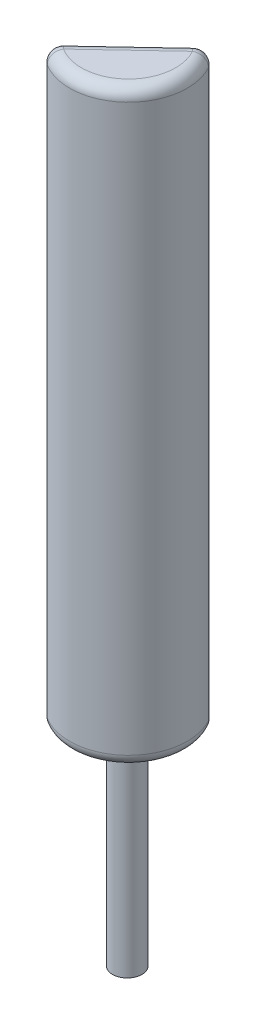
ISO-10303-21;
HEADER;
FILE_DESCRIPTION(('STEP AP214'),'2;1');
FILE_NAME('part.step','',(''),(''),'','','');
FILE_SCHEMA(('AUTOMOTIVE_DESIGN { 1 0 10303 214 1 1 1 1 }'));
ENDSEC;
DATA;
#1=APPLICATION_CONTEXT('core data for automotive mechanical design processes');
#2=APPLICATION_PROTOCOL_DEFINITION('international standard','automotive_design',2000,#1);
#3=PRODUCT_CONTEXT('',#1,'mechanical');
#4=PRODUCT('Part','Part','',(#3));
#5=PRODUCT_RELATED_PRODUCT_CATEGORY('part','',(#4));
#6=PRODUCT_DEFINITION_FORMATION('','',#4);
#7=PRODUCT_DEFINITION_CONTEXT('part definition',#1,'design');
#8=PRODUCT_DEFINITION('design','',#6,#7);
#9=PRODUCT_DEFINITION_SHAPE('','',#8);
#10=(LENGTH_UNIT() NAMED_UNIT(*) SI_UNIT(.MILLI.,.METRE.));
#11=(NAMED_UNIT(*) PLANE_ANGLE_UNIT() SI_UNIT($,.RADIAN.));
#12=(NAMED_UNIT(*) SI_UNIT($,.STERADIAN.) SOLID_ANGLE_UNIT());
#13=UNCERTAINTY_MEASURE_WITH_UNIT(LENGTH_MEASURE(1.E-05),#10,'distance_accuracy_value','');
#14=(GEOMETRIC_REPRESENTATION_CONTEXT(3) GLOBAL_UNCERTAINTY_ASSIGNED_CONTEXT((#13)) GLOBAL_UNIT_ASSIGNED_CONTEXT((#10,
#11,#12)) REPRESENTATION_CONTEXT('',''));
#15=CARTESIAN_POINT('',(0.,0.,0.));
#16=DIRECTION('',(0.,0.,1.));
#17=DIRECTION('',(1.,0.,0.));
#18=AXIS2_PLACEMENT_3D('',#15,#16,#17);
#19=CARTESIAN_POINT('',(0.,0.,0.));
#20=DIRECTION('',(0.,-1.,0.));
#21=DIRECTION('',(0.,0.,-1.));
#22=AXIS2_PLACEMENT_3D('',#19,#20,#21);
#23=PLANE('',#22);
#24=CARTESIAN_POINT('',(0.,0.,0.));
#25=DIRECTION('',(0.,-1.,0.));
#26=DIRECTION('',(0.,0.,-1.));
#27=AXIS2_PLACEMENT_3D('',#24,#25,#26);
#28=CIRCLE('',#27,3.2);
#29=CARTESIAN_POINT('',(2.80519584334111,0.,-1.539765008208));
#30=VERTEX_POINT('',#29);
#31=CARTESIAN_POINT('',(-1.70911083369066,0.,2.7053539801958));
#32=VERTEX_POINT('',#31);
#33=EDGE_CURVE('E120',#30,#32,#28,.T.);
#34=ORIENTED_EDGE('',*,*,#33,.T.);
#35=DIRECTION('',(-0.728493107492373,0.,0.685053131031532));
#36=VECTOR('',#35,1.);
#37=CARTESIAN_POINT('',(3.46201493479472,0.,-2.15741803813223));
#38=LINE('',#37,#36);
#39=EDGE_CURVE('E91',#32,#30,#38,.F.);
#40=ORIENTED_EDGE('',*,*,#39,.T.);
#41=EDGE_LOOP('',(#34,#40));
#42=FACE_BOUND('',#41,.T.);
#43=CARTESIAN_POINT('',(1.37010626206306,0.,1.45698621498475));
#44=DIRECTION('',(0.,-1.,0.));
#45=DIRECTION('',(0.,0.,-1.));
#46=AXIS2_PLACEMENT_3D('',#43,#44,#45);
#47=CIRCLE('',#46,1.);
#48=CARTESIAN_POINT('',(1.37010626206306,0.,2.45698621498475));
#49=VERTEX_POINT('',#48);
#50=EDGE_CURVE('E155',#49,#49,#47,.T.);
#51=ORIENTED_EDGE('',*,*,#50,.F.);
#52=EDGE_LOOP('',(#51));
#53=FACE_BOUND('',#52,.T.);
#54=ADVANCED_FACE('F32',(#42,#53),#23,.T.);
#55=CARTESIAN_POINT('',(0.,40.,0.));
#56=DIRECTION('',(0.,-1.,0.));
#57=DIRECTION('',(0.,0.,-1.));
#58=AXIS2_PLACEMENT_3D('',#55,#56,#57);
#59=CYLINDRICAL_SURFACE('',#58,4.);
#60=DIRECTION('',(0.,-1.,0.));
#61=VECTOR('',#60,1.);
#62=CARTESIAN_POINT('',(-2.13638854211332,40.,3.38169247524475));
#63=LINE('',#62,#61);
#64=CARTESIAN_POINT('',(-2.13638854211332,39.2,3.38169247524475));
#65=VERTEX_POINT('',#64);
#66=CARTESIAN_POINT('',(-2.13638854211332,0.800000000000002,3.38169247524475));
#67=VERTEX_POINT('',#66);
#68=EDGE_CURVE('E52',#65,#67,#63,.T.);
#69=ORIENTED_EDGE('',*,*,#68,.T.);
#70=CARTESIAN_POINT('',(0.,0.800000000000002,0.));
#71=DIRECTION('',(0.,-1.,0.));
#72=DIRECTION('',(0.,0.,-1.));
#73=AXIS2_PLACEMENT_3D('',#70,#71,#72);
#74=CIRCLE('',#73,4.);
#75=CARTESIAN_POINT('',(3.50649480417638,0.800000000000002,-1.92470626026));
#76=VERTEX_POINT('',#75);
#77=EDGE_CURVE('E11',#67,#76,#74,.F.);
#78=ORIENTED_EDGE('',*,*,#77,.T.);
#79=DIRECTION('',(0.,-1.,0.));
#80=VECTOR('',#79,1.);
#81=CARTESIAN_POINT('',(3.50649480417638,40.,-1.92470626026));
#82=LINE('',#81,#80);
#83=CARTESIAN_POINT('',(3.50649480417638,39.2,-1.92470626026));
#84=VERTEX_POINT('',#83);
#85=EDGE_CURVE('E41',#76,#84,#82,.F.);
#86=ORIENTED_EDGE('',*,*,#85,.T.);
#87=CARTESIAN_POINT('',(0.,39.2,0.));
#88=DIRECTION('',(0.,-1.,0.));
#89=DIRECTION('',(0.,0.,-1.));
#90=AXIS2_PLACEMENT_3D('',#87,#88,#89);
#91=CIRCLE('',#90,4.);
#92=EDGE_CURVE('E131',#84,#65,#91,.T.);
#93=ORIENTED_EDGE('',*,*,#92,.T.);
#94=EDGE_LOOP('',(#69,#78,#86,#93));
#95=FACE_BOUND('',#94,.T.);
#96=ADVANCED_FACE('F180',(#95),#59,.T.);
#97=CARTESIAN_POINT('',(-2.91397242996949,40.,2.74021252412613));
#98=DIRECTION('',(0.685053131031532,0.,0.728493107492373));
#99=DIRECTION('',(0.728493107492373,0.,-0.685053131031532));
#100=AXIS2_PLACEMENT_3D('',#97,#98,#99);
#101=PLANE('',#100);
#102=DIRECTION('',(-0.728493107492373,0.,0.685053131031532));
#103=VECTOR('',#102,1.);
#104=CARTESIAN_POINT('',(-2.91397242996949,39.2,2.74021252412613));
#105=LINE('',#104,#103);
#106=CARTESIAN_POINT('',(-2.25715333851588,39.2,2.1225594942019));
#107=VERTEX_POINT('',#106);
#108=CARTESIAN_POINT('',(2.25715333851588,39.2,-2.1225594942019));
#109=VERTEX_POINT('',#108);
#110=EDGE_CURVE('E112',#107,#109,#105,.F.);
#111=ORIENTED_EDGE('',*,*,#110,.T.);
#112=DIRECTION('',(0.,-1.,0.));
#113=VECTOR('',#112,1.);
#114=CARTESIAN_POINT('',(2.25715333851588,40.,-2.1225594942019));
#115=LINE('',#114,#113);
#116=CARTESIAN_POINT('',(2.25715333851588,0.800000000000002,-2.1225594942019));
#117=VERTEX_POINT('',#116);
#118=EDGE_CURVE('E117',#109,#117,#115,.T.);
#119=ORIENTED_EDGE('',*,*,#118,.T.);
#120=DIRECTION('',(-0.728493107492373,0.,0.685053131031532));
#121=VECTOR('',#120,1.);
#122=CARTESIAN_POINT('',(-2.91397242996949,0.800000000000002,2.74021252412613));
#123=LINE('',#122,#121);
#124=CARTESIAN_POINT('',(-2.25715333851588,0.800000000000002,2.1225594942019));
#125=VERTEX_POINT('',#124);
#126=EDGE_CURVE('E89',#117,#125,#123,.T.);
#127=ORIENTED_EDGE('',*,*,#126,.T.);
#128=DIRECTION('',(0.,-1.,0.));
#129=VECTOR('',#128,1.);
#130=CARTESIAN_POINT('',(-2.25715333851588,40.,2.1225594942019));
#131=LINE('',#130,#129);
#132=EDGE_CURVE('E106',#125,#107,#131,.F.);
#133=ORIENTED_EDGE('',*,*,#132,.T.);
#134=EDGE_LOOP('',(#111,#119,#127,#133));
#135=FACE_BOUND('',#134,.T.);
#136=ADVANCED_FACE('F115',(#135),#101,.F.);
#137=CARTESIAN_POINT('',(0.,40.,0.));
#138=DIRECTION('',(0.,-1.,0.));
#139=DIRECTION('',(0.,0.,-1.));
#140=AXIS2_PLACEMENT_3D('',#137,#138,#139);
#141=PLANE('',#140);
#142=CARTESIAN_POINT('',(0.,40.,0.));
#143=DIRECTION('',(0.,-1.,0.));
#144=DIRECTION('',(0.,0.,-1.));
#145=AXIS2_PLACEMENT_3D('',#142,#143,#144);
#146=CIRCLE('',#145,3.2);
#147=CARTESIAN_POINT('',(-1.70911083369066,40.,2.7053539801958));
#148=VERTEX_POINT('',#147);
#149=CARTESIAN_POINT('',(2.80519584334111,40.,-1.539765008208));
#150=VERTEX_POINT('',#149);
#151=EDGE_CURVE('E126',#148,#150,#146,.F.);
#152=ORIENTED_EDGE('',*,*,#151,.T.);
#153=DIRECTION('',(-0.728493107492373,0.,0.685053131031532));
#154=VECTOR('',#153,1.);
#155=CARTESIAN_POINT('',(0.548042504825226,40.,0.582794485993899));
#156=LINE('',#155,#154);
#157=EDGE_CURVE('E128',#150,#148,#156,.T.);
#158=ORIENTED_EDGE('',*,*,#157,.T.);
#159=EDGE_LOOP('',(#152,#158));
#160=FACE_BOUND('',#159,.T.);
#161=ADVANCED_FACE('F170',(#160),#141,.F.);
#162=CARTESIAN_POINT('',(1.37010626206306,-13.,1.45698621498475));
#163=DIRECTION('',(0.,1.,0.));
#164=DIRECTION('',(0.,0.,1.));
#165=AXIS2_PLACEMENT_3D('',#162,#163,#164);
#166=CYLINDRICAL_SURFACE('',#165,1.);
#167=CARTESIAN_POINT('',(1.37010626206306,-13.,1.45698621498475));
#168=DIRECTION('',(0.,-1.,0.));
#169=DIRECTION('',(0.,0.,-1.));
#170=AXIS2_PLACEMENT_3D('',#167,#168,#169);
#171=CIRCLE('',#170,1.);
#172=CARTESIAN_POINT('',(1.37010626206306,-13.,2.45698621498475));
#173=VERTEX_POINT('',#172);
#174=EDGE_CURVE('E113',#173,#173,#171,.T.);
#175=CARTESIAN_POINT('',(1.37010626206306,-13.,2.45698621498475));
#176=CARTESIAN_POINT('',(1.37010626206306,-12.8645833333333,2.45698621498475));
#177=CARTESIAN_POINT('',(1.37010626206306,-12.7291666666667,2.45698621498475));
#178=CARTESIAN_POINT('',(1.37010626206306,-12.4583333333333,2.45698621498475));
#179=CARTESIAN_POINT('',(1.37010626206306,-12.3229166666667,2.45698621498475));
#180=CARTESIAN_POINT('',(1.37010626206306,-12.0520833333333,2.45698621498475));
#181=CARTESIAN_POINT('',(1.37010626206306,-11.9166666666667,2.45698621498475));
#182=CARTESIAN_POINT('',(1.37010626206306,-11.6458333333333,2.45698621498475));
#183=CARTESIAN_POINT('',(1.37010626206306,-11.5104166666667,2.45698621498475));
#184=CARTESIAN_POINT('',(1.37010626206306,-11.2395833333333,2.45698621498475));
#185=CARTESIAN_POINT('',(1.37010626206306,-11.1041666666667,2.45698621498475));
#186=CARTESIAN_POINT('',(1.37010626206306,-10.8333333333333,2.45698621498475));
#187=CARTESIAN_POINT('',(1.37010626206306,-10.6979166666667,2.45698621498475));
#188=CARTESIAN_POINT('',(1.37010626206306,-10.4270833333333,2.45698621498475));
#189=CARTESIAN_POINT('',(1.37010626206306,-10.2916666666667,2.45698621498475));
#190=CARTESIAN_POINT('',(1.37010626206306,-10.0208333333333,2.45698621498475));
#191=CARTESIAN_POINT('',(1.37010626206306,-9.88541666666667,2.45698621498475));
#192=CARTESIAN_POINT('',(1.37010626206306,-9.61458333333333,2.45698621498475));
#193=CARTESIAN_POINT('',(1.37010626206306,-9.47916666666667,2.45698621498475));
#194=CARTESIAN_POINT('',(1.37010626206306,-9.20833333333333,2.45698621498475));
#195=CARTESIAN_POINT('',(1.37010626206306,-9.07291666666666,2.45698621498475));
#196=CARTESIAN_POINT('',(1.37010626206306,-8.80208333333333,2.45698621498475));
#197=CARTESIAN_POINT('',(1.37010626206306,-8.66666666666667,2.45698621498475));
#198=CARTESIAN_POINT('',(1.37010626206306,-8.39583333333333,2.45698621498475));
#199=CARTESIAN_POINT('',(1.37010626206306,-8.26041666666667,2.45698621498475));
#200=CARTESIAN_POINT('',(1.37010626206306,-7.98958333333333,2.45698621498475));
#201=CARTESIAN_POINT('',(1.37010626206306,-7.85416666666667,2.45698621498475));
#202=CARTESIAN_POINT('',(1.37010626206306,-7.58333333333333,2.45698621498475));
#203=CARTESIAN_POINT('',(1.37010626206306,-7.44791666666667,2.45698621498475));
#204=CARTESIAN_POINT('',(1.37010626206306,-7.17708333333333,2.45698621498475));
#205=CARTESIAN_POINT('',(1.37010626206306,-7.04166666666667,2.45698621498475));
#206=CARTESIAN_POINT('',(1.37010626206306,-6.77083333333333,2.45698621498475));
#207=CARTESIAN_POINT('',(1.37010626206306,-6.63541666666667,2.45698621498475));
#208=CARTESIAN_POINT('',(1.37010626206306,-6.36458333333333,2.45698621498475));
#209=CARTESIAN_POINT('',(1.37010626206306,-6.22916666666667,2.45698621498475));
#210=CARTESIAN_POINT('',(1.37010626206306,-5.95833333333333,2.45698621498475));
#211=CARTESIAN_POINT('',(1.37010626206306,-5.82291666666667,2.45698621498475));
#212=CARTESIAN_POINT('',(1.37010626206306,-5.55208333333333,2.45698621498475));
#213=CARTESIAN_POINT('',(1.37010626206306,-5.41666666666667,2.45698621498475));
#214=CARTESIAN_POINT('',(1.37010626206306,-5.14583333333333,2.45698621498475));
#215=CARTESIAN_POINT('',(1.37010626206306,-5.01041666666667,2.45698621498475));
#216=CARTESIAN_POINT('',(1.37010626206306,-4.73958333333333,2.45698621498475));
#217=CARTESIAN_POINT('',(1.37010626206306,-4.60416666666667,2.45698621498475));
#218=CARTESIAN_POINT('',(1.37010626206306,-4.33333333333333,2.45698621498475));
#219=CARTESIAN_POINT('',(1.37010626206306,-4.19791666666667,2.45698621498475));
#220=CARTESIAN_POINT('',(1.37010626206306,-3.92708333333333,2.45698621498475));
#221=CARTESIAN_POINT('',(1.37010626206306,-3.79166666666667,2.45698621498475));
#222=CARTESIAN_POINT('',(1.37010626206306,-3.52083333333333,2.45698621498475));
#223=CARTESIAN_POINT('',(1.37010626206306,-3.38541666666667,2.45698621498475));
#224=CARTESIAN_POINT('',(1.37010626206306,-3.11458333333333,2.45698621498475));
#225=CARTESIAN_POINT('',(1.37010626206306,-2.97916666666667,2.45698621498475));
#226=CARTESIAN_POINT('',(1.37010626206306,-2.70833333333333,2.45698621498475));
#227=CARTESIAN_POINT('',(1.37010626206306,-2.57291666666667,2.45698621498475));
#228=CARTESIAN_POINT('',(1.37010626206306,-2.30208333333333,2.45698621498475));
#229=CARTESIAN_POINT('',(1.37010626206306,-2.16666666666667,2.45698621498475));
#230=CARTESIAN_POINT('',(1.37010626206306,-1.89583333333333,2.45698621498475));
#231=CARTESIAN_POINT('',(1.37010626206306,-1.76041666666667,2.45698621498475));
#232=CARTESIAN_POINT('',(1.37010626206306,-1.48958333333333,2.45698621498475));
#233=CARTESIAN_POINT('',(1.37010626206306,-1.35416666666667,2.45698621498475));
#234=CARTESIAN_POINT('',(1.37010626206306,-1.08333333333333,2.45698621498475));
#235=CARTESIAN_POINT('',(1.37010626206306,-0.947916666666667,2.45698621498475));
#236=CARTESIAN_POINT('',(1.37010626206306,-0.677083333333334,2.45698621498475));
#237=CARTESIAN_POINT('',(1.37010626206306,-0.541666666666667,2.45698621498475));
#238=CARTESIAN_POINT('',(1.37010626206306,-0.270833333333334,2.45698621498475));
#239=CARTESIAN_POINT('',(1.37010626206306,-0.135416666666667,2.45698621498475));
#240=CARTESIAN_POINT('',(1.37010626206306,0.,2.45698621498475));
#241=B_SPLINE_CURVE_WITH_KNOTS('',3,(#175,#176,#177,#178,#179,#180,#181,#182,#183,#184,#185,
#186,#187,#188,#189,#190,#191,#192,#193,#194,#195,#196,#197,#198,#199,#200,#201,#202,#203,#204,
#205,#206,#207,#208,#209,#210,#211,#212,#213,#214,#215,#216,#217,#218,#219,#220,#221,#222,#223,
#224,#225,#226,#227,#228,#229,#230,#231,#232,#233,#234,#235,#236,#237,#238,#239,#240),
.UNSPECIFIED.,.F.,.F.,(4,2,2,2,2,2,2,2,2,2,2,2,2,2,2,2,2,2,2,2,2,2,2,2,2,2,2,2,2,2,2,2,4),(0.,
0.40625,0.812500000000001,1.21875,1.625,2.03125,2.4375,2.84375,3.25,3.65625,4.0625,4.46875,
4.875,5.28125,5.6875,6.09375,6.5,6.90625,7.3125,7.71875,8.125,8.53125,8.9375,9.34375,9.75,
10.15625,10.5625,10.96875,11.375,11.78125,12.1875,12.59375,13.),.UNSPECIFIED.);
#242=EDGE_CURVE('BSEAM168',#173,#49,#241,.T.);
#243=ORIENTED_EDGE('',*,*,#174,.F.);
#244=ORIENTED_EDGE('',*,*,#50,.T.);
#245=ORIENTED_EDGE('',*,*,#242,.T.);
#246=ORIENTED_EDGE('',*,*,#242,.F.);
#247=EDGE_LOOP('',(#243,#245,#244,#246));
#248=FACE_BOUND('',#247,.T.);
#249=ADVANCED_FACE('F168',(#248),#166,.T.);
#250=CARTESIAN_POINT('',(1.37010626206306,-13.,1.45698621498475));
#251=DIRECTION('',(0.,-1.,0.));
#252=DIRECTION('',(0.,0.,-1.));
#253=AXIS2_PLACEMENT_3D('',#250,#251,#252);
#254=PLANE('',#253);
#255=ORIENTED_EDGE('',*,*,#174,.T.);
#256=EDGE_LOOP('',(#255));
#257=FACE_BOUND('',#256,.T.);
#258=ADVANCED_FACE('F166',(#257),#254,.T.);
#259=CARTESIAN_POINT('',(0.548042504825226,39.2,0.582794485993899));
#260=DIRECTION('',(-0.728493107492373,0.,0.685053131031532));
#261=DIRECTION('',(0.685053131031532,0.,0.728493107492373));
#262=AXIS2_PLACEMENT_3D('',#259,#260,#261);
#263=CYLINDRICAL_SURFACE('',#262,0.8);
#264=CARTESIAN_POINT('',(-1.70911083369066,39.2,2.7053539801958));
#265=DIRECTION('',(-0.728493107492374,0.,0.685053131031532));
#266=DIRECTION('',(0.685053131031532,0.,0.728493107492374));
#267=AXIS2_PLACEMENT_3D('',#264,#265,#266);
#268=CIRCLE('',#267,0.8);
#269=EDGE_CURVE('E147',#148,#107,#268,.T.);
#270=ORIENTED_EDGE('',*,*,#269,.F.);
#271=ORIENTED_EDGE('',*,*,#157,.F.);
#272=CARTESIAN_POINT('',(2.80519584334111,39.2,-1.539765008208));
#273=DIRECTION('',(0.728493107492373,0.,-0.685053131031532));
#274=DIRECTION('',(-0.685053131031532,0.,-0.728493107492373));
#275=AXIS2_PLACEMENT_3D('',#272,#273,#274);
#276=CIRCLE('',#275,0.8);
#277=EDGE_CURVE('E149',#109,#150,#276,.T.);
#278=ORIENTED_EDGE('',*,*,#277,.F.);
#279=ORIENTED_EDGE('',*,*,#110,.F.);
#280=EDGE_LOOP('',(#270,#271,#278,#279));
#281=FACE_BOUND('',#280,.T.);
#282=ADVANCED_FACE('F34',(#281),#263,.T.);
#283=CARTESIAN_POINT('',(0.,39.2,0.));
#284=DIRECTION('',(0.,-1.,0.));
#285=DIRECTION('',(0.,0.,-1.));
#286=AXIS2_PLACEMENT_3D('',#283,#284,#285);
#287=TOROIDAL_SURFACE('',#286,3.2,0.8);
#288=CARTESIAN_POINT('',(2.80519584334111,39.2,-1.539765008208));
#289=DIRECTION('',(-0.481176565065,0.,-0.876623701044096));
#290=DIRECTION('',(-0.876623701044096,0.,0.481176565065));
#291=AXIS2_PLACEMENT_3D('',#288,#289,#290);
#292=CIRCLE('',#291,0.8);
#293=EDGE_CURVE('E36',#150,#84,#292,.T.);
#294=ORIENTED_EDGE('',*,*,#293,.F.);
#295=ORIENTED_EDGE('',*,*,#151,.F.);
#296=CARTESIAN_POINT('',(-1.70911083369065,39.2,2.7053539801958));
#297=DIRECTION('',(-0.845423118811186,0.,-0.534097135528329));
#298=DIRECTION('',(-0.534097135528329,0.,0.845423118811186));
#299=AXIS2_PLACEMENT_3D('',#296,#297,#298);
#300=CIRCLE('',#299,0.8);
#301=EDGE_CURVE('E145',#65,#148,#300,.T.);
#302=ORIENTED_EDGE('',*,*,#301,.F.);
#303=ORIENTED_EDGE('',*,*,#92,.F.);
#304=EDGE_LOOP('',(#294,#295,#302,#303));
#305=FACE_BOUND('',#304,.T.);
#306=ADVANCED_FACE('F215',(#305),#287,.T.);
#307=CARTESIAN_POINT('',(2.80519584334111,39.2,-1.539765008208));
#308=DIRECTION('',(0.,0.,1.));
#309=DIRECTION('',(1.,0.,0.));
#310=AXIS2_PLACEMENT_3D('',#307,#308,#309);
#311=SPHERICAL_SURFACE('',#310,0.8);
#312=ORIENTED_EDGE('',*,*,#277,.T.);
#313=ORIENTED_EDGE('',*,*,#293,.T.);
#314=CARTESIAN_POINT('',(2.80519584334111,39.2,-1.539765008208));
#315=DIRECTION('',(0.,1.,0.));
#316=DIRECTION('',(0.,0.,1.));
#317=AXIS2_PLACEMENT_3D('',#314,#315,#316);
#318=CIRCLE('',#317,0.8);
#319=EDGE_CURVE('E143',#109,#84,#318,.F.);
#320=ORIENTED_EDGE('',*,*,#319,.F.);
#321=EDGE_LOOP('',(#312,#313,#320));
#322=FACE_BOUND('',#321,.T.);
#323=ADVANCED_FACE('F212',(#322),#311,.T.);
#324=CARTESIAN_POINT('',(-1.70911083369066,39.2,2.7053539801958));
#325=DIRECTION('',(0.,0.,1.));
#326=DIRECTION('',(1.,0.,0.));
#327=AXIS2_PLACEMENT_3D('',#324,#325,#326);
#328=SPHERICAL_SURFACE('',#327,0.8);
#329=ORIENTED_EDGE('',*,*,#301,.T.);
#330=ORIENTED_EDGE('',*,*,#269,.T.);
#331=CARTESIAN_POINT('',(-1.70911083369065,39.2,2.7053539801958));
#332=DIRECTION('',(0.,1.,0.));
#333=DIRECTION('',(0.,0.,1.));
#334=AXIS2_PLACEMENT_3D('',#331,#332,#333);
#335=CIRCLE('',#334,0.8);
#336=EDGE_CURVE('E109',#65,#107,#335,.F.);
#337=ORIENTED_EDGE('',*,*,#336,.F.);
#338=EDGE_LOOP('',(#329,#330,#337));
#339=FACE_BOUND('',#338,.T.);
#340=ADVANCED_FACE('F208',(#339),#328,.T.);
#341=CARTESIAN_POINT('',(2.80519584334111,40.,-1.539765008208));
#342=DIRECTION('',(0.,-1.,0.));
#343=DIRECTION('',(0.,0.,-1.));
#344=AXIS2_PLACEMENT_3D('',#341,#342,#343);
#345=CYLINDRICAL_SURFACE('',#344,0.8);
#346=ORIENTED_EDGE('',*,*,#319,.T.);
#347=ORIENTED_EDGE('',*,*,#85,.F.);
#348=CARTESIAN_POINT('',(2.80519584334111,0.800000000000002,-1.539765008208));
#349=DIRECTION('',(0.,-1.,0.));
#350=DIRECTION('',(0.,0.,-1.));
#351=AXIS2_PLACEMENT_3D('',#348,#349,#350);
#352=CIRCLE('',#351,0.8);
#353=EDGE_CURVE('E103',#117,#76,#352,.T.);
#354=ORIENTED_EDGE('',*,*,#353,.F.);
#355=ORIENTED_EDGE('',*,*,#118,.F.);
#356=EDGE_LOOP('',(#346,#347,#354,#355));
#357=FACE_BOUND('',#356,.T.);
#358=ADVANCED_FACE('F205',(#357),#345,.T.);
#359=CARTESIAN_POINT('',(-1.70911083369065,40.,2.7053539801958));
#360=DIRECTION('',(0.,-1.,0.));
#361=DIRECTION('',(0.,0.,-1.));
#362=AXIS2_PLACEMENT_3D('',#359,#360,#361);
#363=CYLINDRICAL_SURFACE('',#362,0.8);
#364=ORIENTED_EDGE('',*,*,#336,.T.);
#365=ORIENTED_EDGE('',*,*,#132,.F.);
#366=CARTESIAN_POINT('',(-1.70911083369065,0.800000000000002,2.7053539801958));
#367=DIRECTION('',(0.,-1.,0.));
#368=DIRECTION('',(0.,0.,-1.));
#369=AXIS2_PLACEMENT_3D('',#366,#367,#368);
#370=CIRCLE('',#369,0.8);
#371=EDGE_CURVE('E97',#67,#125,#370,.T.);
#372=ORIENTED_EDGE('',*,*,#371,.F.);
#373=ORIENTED_EDGE('',*,*,#68,.F.);
#374=EDGE_LOOP('',(#364,#365,#372,#373));
#375=FACE_BOUND('',#374,.T.);
#376=ADVANCED_FACE('F107',(#375),#363,.T.);
#377=CARTESIAN_POINT('',(0.,0.800000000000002,0.));
#378=DIRECTION('',(0.,-1.,0.));
#379=DIRECTION('',(0.,0.,-1.));
#380=AXIS2_PLACEMENT_3D('',#377,#378,#379);
#381=TOROIDAL_SURFACE('',#380,3.2,0.8);
#382=CARTESIAN_POINT('',(2.80519584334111,0.800000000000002,-1.539765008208));
#383=DIRECTION('',(-0.481176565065,0.,-0.876623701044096));
#384=DIRECTION('',(-0.876623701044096,0.,0.481176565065));
#385=AXIS2_PLACEMENT_3D('',#382,#383,#384);
#386=CIRCLE('',#385,0.8);
#387=EDGE_CURVE('E139',#76,#30,#386,.T.);
#388=ORIENTED_EDGE('',*,*,#387,.F.);
#389=ORIENTED_EDGE('',*,*,#77,.F.);
#390=CARTESIAN_POINT('',(-1.70911083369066,0.8,2.7053539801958));
#391=DIRECTION('',(-0.845423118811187,0.,-0.534097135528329));
#392=DIRECTION('',(-0.534097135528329,0.,0.845423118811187));
#393=AXIS2_PLACEMENT_3D('',#390,#391,#392);
#394=CIRCLE('',#393,0.8);
#395=EDGE_CURVE('E101',#32,#67,#394,.T.);
#396=ORIENTED_EDGE('',*,*,#395,.F.);
#397=ORIENTED_EDGE('',*,*,#33,.F.);
#398=EDGE_LOOP('',(#388,#389,#396,#397));
#399=FACE_BOUND('',#398,.T.);
#400=ADVANCED_FACE('F198',(#399),#381,.T.);
#401=CARTESIAN_POINT('',(2.80519584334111,0.8,-1.539765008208));
#402=DIRECTION('',(0.,0.,1.));
#403=DIRECTION('',(1.,0.,0.));
#404=AXIS2_PLACEMENT_3D('',#401,#402,#403);
#405=SPHERICAL_SURFACE('',#404,0.8);
#406=ORIENTED_EDGE('',*,*,#353,.T.);
#407=ORIENTED_EDGE('',*,*,#387,.T.);
#408=CARTESIAN_POINT('',(2.80519584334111,0.8,-1.539765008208));
#409=DIRECTION('',(0.728493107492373,0.,-0.685053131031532));
#410=DIRECTION('',(-0.685053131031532,0.,-0.728493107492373));
#411=AXIS2_PLACEMENT_3D('',#408,#409,#410);
#412=CIRCLE('',#411,0.8);
#413=EDGE_CURVE('E94',#117,#30,#412,.F.);
#414=ORIENTED_EDGE('',*,*,#413,.F.);
#415=EDGE_LOOP('',(#406,#407,#414));
#416=FACE_BOUND('',#415,.T.);
#417=ADVANCED_FACE('F195',(#416),#405,.T.);
#418=CARTESIAN_POINT('',(-1.70911083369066,0.8,2.7053539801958));
#419=DIRECTION('',(0.,0.,1.));
#420=DIRECTION('',(1.,0.,0.));
#421=AXIS2_PLACEMENT_3D('',#418,#419,#420);
#422=SPHERICAL_SURFACE('',#421,0.8);
#423=ORIENTED_EDGE('',*,*,#395,.T.);
#424=ORIENTED_EDGE('',*,*,#371,.T.);
#425=CARTESIAN_POINT('',(-1.70911083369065,0.800000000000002,2.7053539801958));
#426=DIRECTION('',(-0.728493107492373,0.,0.685053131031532));
#427=DIRECTION('',(0.685053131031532,0.,0.728493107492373));
#428=AXIS2_PLACEMENT_3D('',#425,#426,#427);
#429=CIRCLE('',#428,0.8);
#430=EDGE_CURVE('E85',#32,#125,#429,.F.);
#431=ORIENTED_EDGE('',*,*,#430,.F.);
#432=EDGE_LOOP('',(#423,#424,#431));
#433=FACE_BOUND('',#432,.T.);
#434=ADVANCED_FACE('F99',(#433),#422,.T.);
#435=CARTESIAN_POINT('',(-2.36592992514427,0.800000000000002,3.32300701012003));
#436=DIRECTION('',(0.728493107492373,0.,-0.685053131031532));
#437=DIRECTION('',(-0.685053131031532,0.,-0.728493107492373));
#438=AXIS2_PLACEMENT_3D('',#435,#436,#437);
#439=CYLINDRICAL_SURFACE('',#438,0.8);
#440=ORIENTED_EDGE('',*,*,#413,.T.);
#441=ORIENTED_EDGE('',*,*,#39,.F.);
#442=ORIENTED_EDGE('',*,*,#430,.T.);
#443=ORIENTED_EDGE('',*,*,#126,.F.);
#444=EDGE_LOOP('',(#440,#441,#442,#443));
#445=FACE_BOUND('',#444,.T.);
#446=ADVANCED_FACE('F87',(#445),#439,.T.);
#447=CLOSED_SHELL('',(#54,#96,#136,#161,#249,#258,#282,#306,#323,#340,#358,#376,#400,#417,#434,#446));
#448=MANIFOLD_SOLID_BREP('B2',#447);
#449=ADVANCED_BREP_SHAPE_REPRESENTATION('',(#18,#448),#14);
#450=SHAPE_DEFINITION_REPRESENTATION(#9,#449);
ENDSEC;
END-ISO-10303-21;
